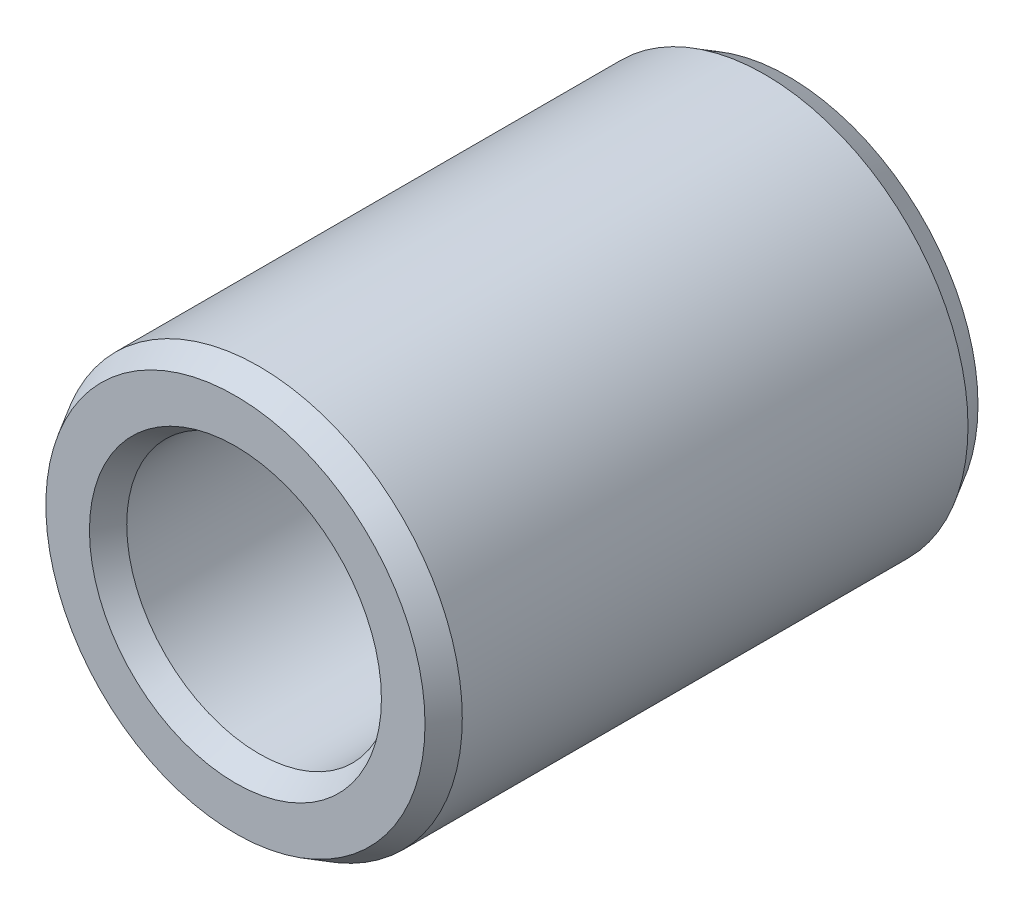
from build123d import *
from OCP.BRepFilletAPI import BRepFilletAPI_MakeChamfer

# Parameters (mm, degrees)
SKETCH1_R          = 2.1844
SKETCH1_R_2        = 1.4224
BASE_EXTRUDE_DEPTH = 5.9436
CHAMFER2_SIZE      = 0.254
CHAMFER2_SIZE2     = 0.146646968


with BuildPart() as part:
    # Sketch1 → Base-Extrude (new body)
    with BuildSketch(Plane.XY):
        Circle(SKETCH1_R)
        Circle(SKETCH1_R_2, mode=Mode.SUBTRACT)
    extrude(amount=BASE_EXTRUDE_DEPTH)

    # Chamfer2: one chamfer whose edges measure the first distance from different faces: ONE call of the kernel's chamfer builder (chamfer() names one face for all edges)
    chamfer2_edges_1 = [part.edges().sort_by_distance(p)[0] for p in [
        (-2.1844, 0, 0),
        (-2.1844, 0, 5.9436),
    ]]
    chamfer2_side_1 = [part.faces().sort_by_distance(p)[0] for p in [
        (-2.1844, 0, 2.9718),
    ]]
    chamfer2_edges_2 = [part.edges().sort_by_distance(p)[0] for p in [
        (-1.4224, 0, 0),
        (-1.4224, 0, 5.9436),
    ]]
    chamfer2_side_2 = [part.faces().sort_by_distance(p)[0] for p in [
        (-1.4224, 0, 2.9718),
    ]]
    chamfer2 = BRepFilletAPI_MakeChamfer(part.part.solid().wrapped)
    for e in chamfer2_edges_1:
        chamfer2.Add(CHAMFER2_SIZE, CHAMFER2_SIZE2, e.wrapped, chamfer2_side_1[0].wrapped)  # the first distance lies on this face
    for e in chamfer2_edges_2:
        chamfer2.Add(CHAMFER2_SIZE, CHAMFER2_SIZE2, e.wrapped, chamfer2_side_2[0].wrapped)  # the first distance lies on this face
    add(Compound.cast(chamfer2.Shape()), mode=Mode.REPLACE)


solid = part.part
